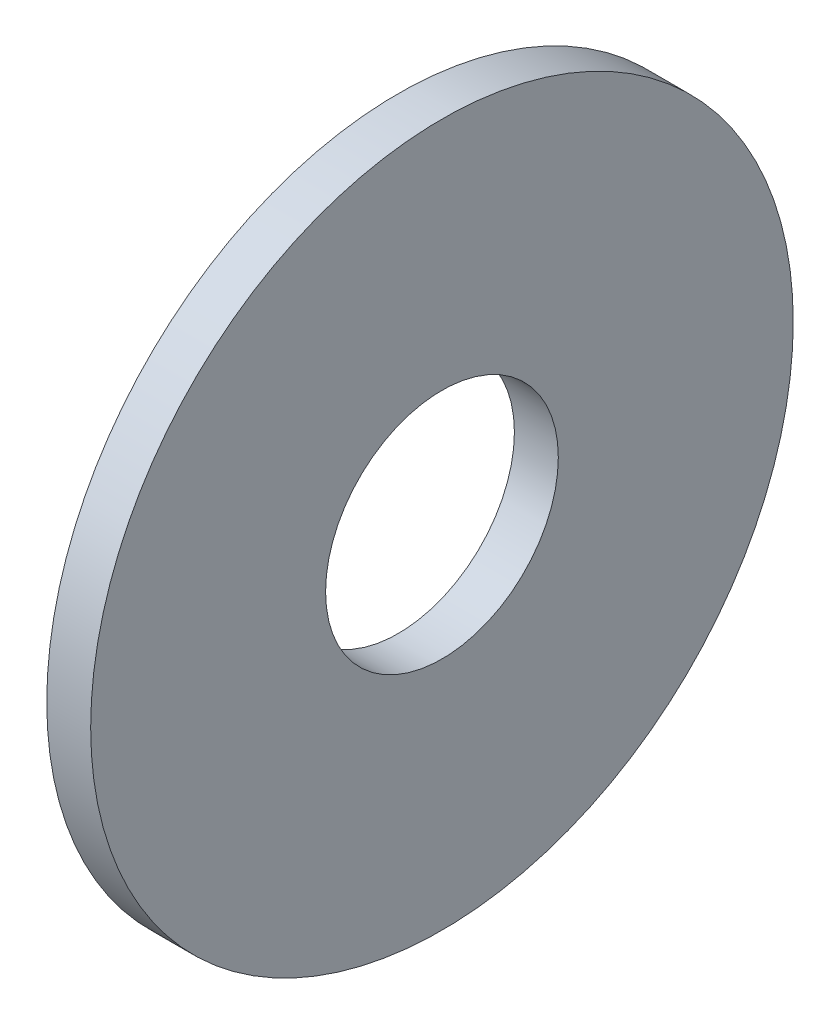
from build123d import *

# Parameters (mm, degrees)
ESQUISSE1_W = 1
ESQUISSE1_H = 5.35


with BuildPart() as part:
    # Esquisse1 → Base-R_volution (revolve)
    with BuildSketch(Plane(origin=(0, 0, 0), x_dir=(1, 0, 0), z_dir=(0, 1, 0)), mode=Mode.PRIVATE) as base_r_volution_sk:
        with Locations((0.5, 5.325)):
            Rectangle(ESQUISSE1_W, ESQUISSE1_H)
    revolve(base_r_volution_sk.sketch.rotate(Axis((0, 0, 0), (1, 0, 0)), 180), axis=Axis((0, 0, 0), (1, 0, 0)))


solid = part.part
